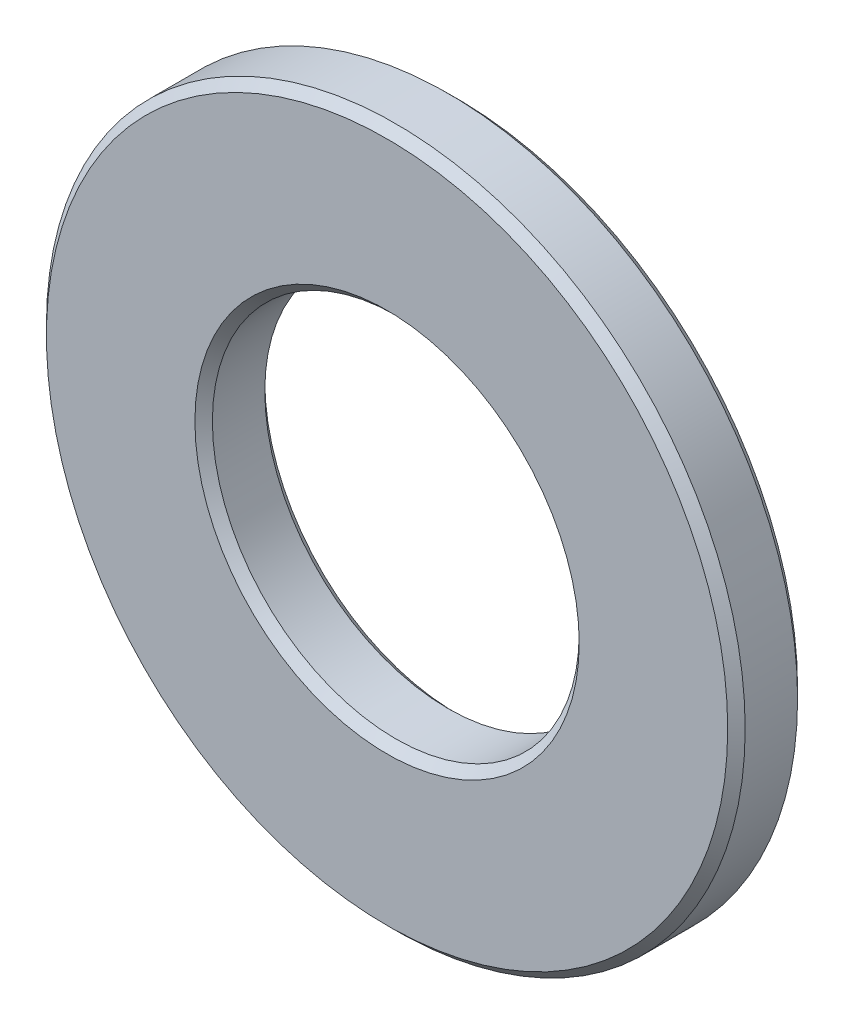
ISO-10303-21;
HEADER;
FILE_DESCRIPTION(('STEP AP214'),'2;1');
FILE_NAME('part.step','',(''),(''),'','','');
FILE_SCHEMA(('AUTOMOTIVE_DESIGN { 1 0 10303 214 1 1 1 1 }'));
ENDSEC;
DATA;
#1=APPLICATION_CONTEXT('core data for automotive mechanical design processes');
#2=APPLICATION_PROTOCOL_DEFINITION('international standard','automotive_design',2000,#1);
#3=PRODUCT_CONTEXT('',#1,'mechanical');
#4=PRODUCT('Part','Part','',(#3));
#5=PRODUCT_RELATED_PRODUCT_CATEGORY('part','',(#4));
#6=PRODUCT_DEFINITION_FORMATION('','',#4);
#7=PRODUCT_DEFINITION_CONTEXT('part definition',#1,'design');
#8=PRODUCT_DEFINITION('design','',#6,#7);
#9=PRODUCT_DEFINITION_SHAPE('','',#8);
#10=(LENGTH_UNIT() NAMED_UNIT(*) SI_UNIT(.MILLI.,.METRE.));
#11=(NAMED_UNIT(*) PLANE_ANGLE_UNIT() SI_UNIT($,.RADIAN.));
#12=(NAMED_UNIT(*) SI_UNIT($,.STERADIAN.) SOLID_ANGLE_UNIT());
#13=UNCERTAINTY_MEASURE_WITH_UNIT(LENGTH_MEASURE(1.E-05),#10,'distance_accuracy_value','');
#14=(GEOMETRIC_REPRESENTATION_CONTEXT(3) GLOBAL_UNCERTAINTY_ASSIGNED_CONTEXT((#13)) GLOBAL_UNIT_ASSIGNED_CONTEXT((#10,
#11,#12)) REPRESENTATION_CONTEXT('',''));
#15=CARTESIAN_POINT('',(0.,0.,0.));
#16=DIRECTION('',(0.,0.,1.));
#17=DIRECTION('',(1.,0.,0.));
#18=AXIS2_PLACEMENT_3D('',#15,#16,#17);
#19=CARTESIAN_POINT('',(0.,0.,0.8));
#20=DIRECTION('',(0.,0.,1.));
#21=DIRECTION('',(1.,0.,0.));
#22=AXIS2_PLACEMENT_3D('',#19,#20,#21);
#23=PLANE('',#22);
#24=CARTESIAN_POINT('',(0.,0.,0.8));
#25=DIRECTION('',(0.,0.,1.));
#26=DIRECTION('',(1.,0.,0.));
#27=AXIS2_PLACEMENT_3D('',#24,#25,#26);
#28=CIRCLE('',#27,4.4);
#29=CARTESIAN_POINT('',(4.4,0.,0.8));
#30=VERTEX_POINT('',#29);
#31=EDGE_CURVE('E10',#30,#30,#28,.F.);
#32=ORIENTED_EDGE('',*,*,#31,.T.);
#33=EDGE_LOOP('',(#32));
#34=FACE_BOUND('',#33,.T.);
#35=CARTESIAN_POINT('',(0.,0.,0.8));
#36=DIRECTION('',(0.,0.,1.));
#37=DIRECTION('',(1.,0.,0.));
#38=AXIS2_PLACEMENT_3D('',#35,#36,#37);
#39=CIRCLE('',#38,7.8);
#40=CARTESIAN_POINT('',(7.8,0.,0.8));
#41=VERTEX_POINT('',#40);
#42=EDGE_CURVE('E69',#41,#41,#39,.T.);
#43=ORIENTED_EDGE('',*,*,#42,.T.);
#44=EDGE_LOOP('',(#43));
#45=FACE_BOUND('',#44,.T.);
#46=ADVANCED_FACE('F39',(#34,#45),#23,.T.);
#47=CARTESIAN_POINT('',(0.,0.,-0.8));
#48=DIRECTION('',(0.,0.,1.));
#49=DIRECTION('',(1.,0.,0.));
#50=AXIS2_PLACEMENT_3D('',#47,#48,#49);
#51=PLANE('',#50);
#52=CARTESIAN_POINT('',(0.,0.,-0.8));
#53=DIRECTION('',(0.,0.,1.));
#54=DIRECTION('',(1.,0.,0.));
#55=AXIS2_PLACEMENT_3D('',#52,#53,#54);
#56=CIRCLE('',#55,4.4);
#57=CARTESIAN_POINT('',(4.4,0.,-0.8));
#58=VERTEX_POINT('',#57);
#59=EDGE_CURVE('E55',#58,#58,#56,.T.);
#60=ORIENTED_EDGE('',*,*,#59,.T.);
#61=EDGE_LOOP('',(#60));
#62=FACE_BOUND('',#61,.T.);
#63=CARTESIAN_POINT('',(0.,0.,-0.8));
#64=DIRECTION('',(0.,0.,1.));
#65=DIRECTION('',(1.,0.,0.));
#66=AXIS2_PLACEMENT_3D('',#63,#64,#65);
#67=CIRCLE('',#66,7.8);
#68=CARTESIAN_POINT('',(7.8,0.,-0.8));
#69=VERTEX_POINT('',#68);
#70=EDGE_CURVE('E60',#69,#69,#67,.F.);
#71=ORIENTED_EDGE('',*,*,#70,.T.);
#72=EDGE_LOOP('',(#71));
#73=FACE_BOUND('',#72,.T.);
#74=ADVANCED_FACE('F94',(#62,#73),#51,.F.);
#75=CARTESIAN_POINT('',(0.,0.,0.8));
#76=DIRECTION('',(0.,0.,-1.));
#77=DIRECTION('',(-1.,0.,0.));
#78=AXIS2_PLACEMENT_3D('',#75,#76,#77);
#79=CYLINDRICAL_SURFACE('',#78,8.);
#80=CARTESIAN_POINT('',(0.,0.,-0.599999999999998));
#81=DIRECTION('',(0.,0.,1.));
#82=DIRECTION('',(1.,0.,0.));
#83=AXIS2_PLACEMENT_3D('',#80,#81,#82);
#84=CIRCLE('',#83,8.);
#85=CARTESIAN_POINT('',(8.,0.,-0.599999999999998));
#86=VERTEX_POINT('',#85);
#87=EDGE_CURVE('E63',#86,#86,#84,.T.);
#88=ORIENTED_EDGE('',*,*,#87,.T.);
#89=EDGE_LOOP('',(#88));
#90=FACE_BOUND('',#89,.T.);
#91=CARTESIAN_POINT('',(0.,0.,0.600000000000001));
#92=DIRECTION('',(0.,0.,1.));
#93=DIRECTION('',(1.,0.,0.));
#94=AXIS2_PLACEMENT_3D('',#91,#92,#93);
#95=CIRCLE('',#94,8.);
#96=CARTESIAN_POINT('',(8.,0.,0.600000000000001));
#97=VERTEX_POINT('',#96);
#98=EDGE_CURVE('E66',#97,#97,#95,.F.);
#99=ORIENTED_EDGE('',*,*,#98,.T.);
#100=EDGE_LOOP('',(#99));
#101=FACE_BOUND('',#100,.T.);
#102=ADVANCED_FACE('F88',(#90,#101),#79,.T.);
#103=CARTESIAN_POINT('',(0.,0.,0.8));
#104=DIRECTION('',(0.,0.,-1.));
#105=DIRECTION('',(-1.,0.,0.));
#106=AXIS2_PLACEMENT_3D('',#103,#104,#105);
#107=CYLINDRICAL_SURFACE('',#106,4.2);
#108=CARTESIAN_POINT('',(0.,0.,0.6));
#109=DIRECTION('',(0.,0.,1.));
#110=DIRECTION('',(1.,0.,0.));
#111=AXIS2_PLACEMENT_3D('',#108,#109,#110);
#112=CIRCLE('',#111,4.2);
#113=CARTESIAN_POINT('',(4.2,0.,0.6));
#114=VERTEX_POINT('',#113);
#115=EDGE_CURVE('E47',#114,#114,#112,.T.);
#116=ORIENTED_EDGE('',*,*,#115,.T.);
#117=EDGE_LOOP('',(#116));
#118=FACE_BOUND('',#117,.T.);
#119=CARTESIAN_POINT('',(0.,0.,-0.599999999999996));
#120=DIRECTION('',(0.,0.,1.));
#121=DIRECTION('',(1.,0.,0.));
#122=AXIS2_PLACEMENT_3D('',#119,#120,#121);
#123=CIRCLE('',#122,4.2);
#124=CARTESIAN_POINT('',(4.2,0.,-0.599999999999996));
#125=VERTEX_POINT('',#124);
#126=EDGE_CURVE('E51',#125,#125,#123,.F.);
#127=ORIENTED_EDGE('',*,*,#126,.T.);
#128=EDGE_LOOP('',(#127));
#129=FACE_BOUND('',#128,.T.);
#130=ADVANCED_FACE('F77',(#118,#129),#107,.F.);
#131=CARTESIAN_POINT('',(0.,0.,0.8));
#132=DIRECTION('',(0.,0.,-1.));
#133=DIRECTION('',(-1.,0.,0.));
#134=AXIS2_PLACEMENT_3D('',#131,#132,#133);
#135=CONICAL_SURFACE('',#134,7.8,0.785398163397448);
#136=ORIENTED_EDGE('',*,*,#98,.F.);
#137=EDGE_LOOP('',(#136));
#138=FACE_BOUND('',#137,.T.);
#139=ORIENTED_EDGE('',*,*,#42,.F.);
#140=EDGE_LOOP('',(#139));
#141=FACE_BOUND('',#140,.T.);
#142=ADVANCED_FACE('F74',(#138,#141),#135,.T.);
#143=CARTESIAN_POINT('',(0.,0.,-0.599999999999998));
#144=DIRECTION('',(0.,0.,1.));
#145=DIRECTION('',(1.,0.,0.));
#146=AXIS2_PLACEMENT_3D('',#143,#144,#145);
#147=CONICAL_SURFACE('',#146,8.,0.785398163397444);
#148=ORIENTED_EDGE('',*,*,#70,.F.);
#149=EDGE_LOOP('',(#148));
#150=FACE_BOUND('',#149,.T.);
#151=ORIENTED_EDGE('',*,*,#87,.F.);
#152=EDGE_LOOP('',(#151));
#153=FACE_BOUND('',#152,.T.);
#154=ADVANCED_FACE('F76',(#150,#153),#147,.T.);
#155=CARTESIAN_POINT('',(0.,0.,-0.8));
#156=DIRECTION('',(0.,0.,-1.));
#157=DIRECTION('',(-1.,0.,0.));
#158=AXIS2_PLACEMENT_3D('',#155,#156,#157);
#159=CONICAL_SURFACE('',#158,4.4,0.785398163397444);
#160=ORIENTED_EDGE('',*,*,#126,.F.);
#161=EDGE_LOOP('',(#160));
#162=FACE_BOUND('',#161,.T.);
#163=ORIENTED_EDGE('',*,*,#59,.F.);
#164=EDGE_LOOP('',(#163));
#165=FACE_BOUND('',#164,.T.);
#166=ADVANCED_FACE('F84',(#162,#165),#159,.F.);
#167=CARTESIAN_POINT('',(0.,0.,0.6));
#168=DIRECTION('',(0.,0.,1.));
#169=DIRECTION('',(1.,0.,0.));
#170=AXIS2_PLACEMENT_3D('',#167,#168,#169);
#171=CONICAL_SURFACE('',#170,4.2,0.78539816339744);
#172=ORIENTED_EDGE('',*,*,#31,.F.);
#173=EDGE_LOOP('',(#172));
#174=FACE_BOUND('',#173,.T.);
#175=ORIENTED_EDGE('',*,*,#115,.F.);
#176=EDGE_LOOP('',(#175));
#177=FACE_BOUND('',#176,.T.);
#178=ADVANCED_FACE('F42',(#174,#177),#171,.F.);
#179=CLOSED_SHELL('',(#46,#74,#102,#130,#142,#154,#166,#178));
#180=MANIFOLD_SOLID_BREP('B2',#179);
#181=ADVANCED_BREP_SHAPE_REPRESENTATION('',(#18,#180),#14);
#182=SHAPE_DEFINITION_REPRESENTATION(#9,#181);
ENDSEC;
END-ISO-10303-21;
